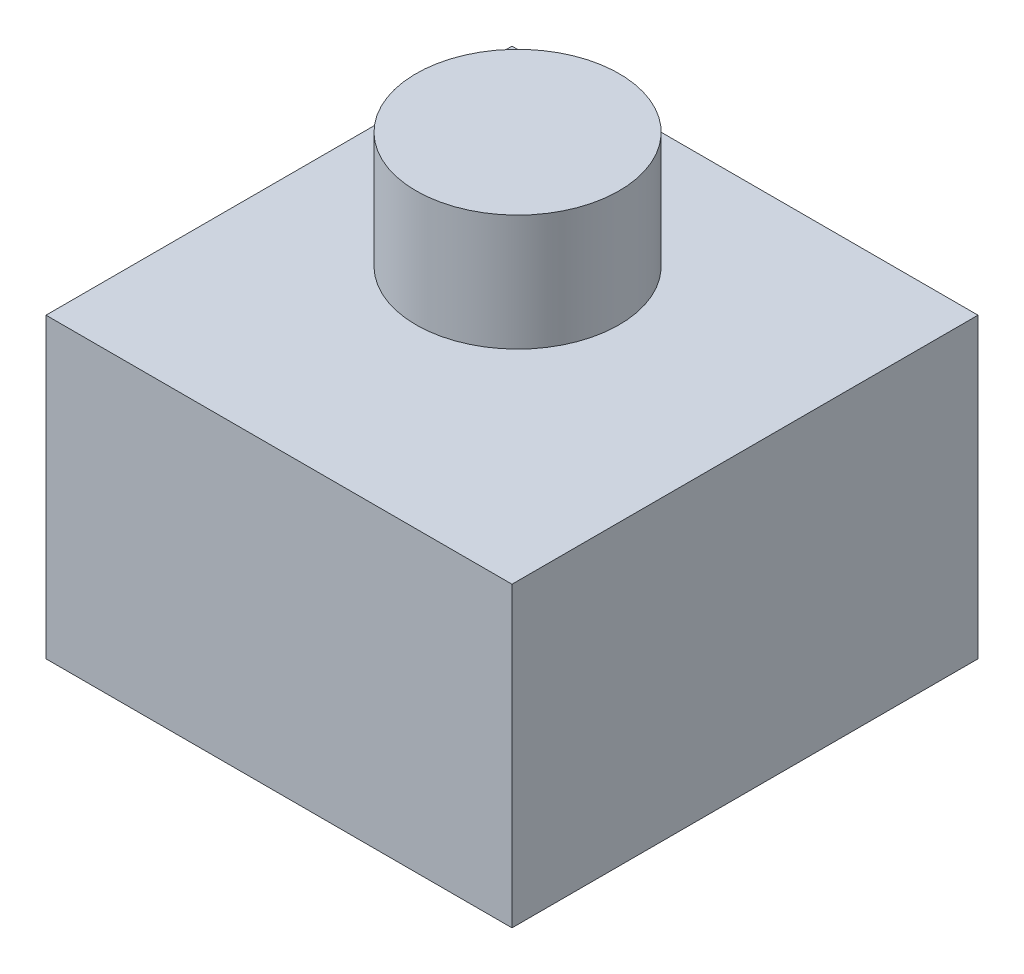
ISO-10303-21;
HEADER;
FILE_DESCRIPTION(('STEP AP214'),'2;1');
FILE_NAME('part.step','',(''),(''),'','','');
FILE_SCHEMA(('AUTOMOTIVE_DESIGN { 1 0 10303 214 1 1 1 1 }'));
ENDSEC;
DATA;
#1=APPLICATION_CONTEXT('core data for automotive mechanical design processes');
#2=APPLICATION_PROTOCOL_DEFINITION('international standard','automotive_design',2000,#1);
#3=PRODUCT_CONTEXT('',#1,'mechanical');
#4=PRODUCT('Part','Part','',(#3));
#5=PRODUCT_RELATED_PRODUCT_CATEGORY('part','',(#4));
#6=PRODUCT_DEFINITION_FORMATION('','',#4);
#7=PRODUCT_DEFINITION_CONTEXT('part definition',#1,'design');
#8=PRODUCT_DEFINITION('design','',#6,#7);
#9=PRODUCT_DEFINITION_SHAPE('','',#8);
#10=(LENGTH_UNIT() NAMED_UNIT(*) SI_UNIT(.MILLI.,.METRE.));
#11=(NAMED_UNIT(*) PLANE_ANGLE_UNIT() SI_UNIT($,.RADIAN.));
#12=(NAMED_UNIT(*) SI_UNIT($,.STERADIAN.) SOLID_ANGLE_UNIT());
#13=UNCERTAINTY_MEASURE_WITH_UNIT(LENGTH_MEASURE(1.E-05),#10,'distance_accuracy_value','');
#14=(GEOMETRIC_REPRESENTATION_CONTEXT(3) GLOBAL_UNCERTAINTY_ASSIGNED_CONTEXT((#13)) GLOBAL_UNIT_ASSIGNED_CONTEXT((#10,
#11,#12)) REPRESENTATION_CONTEXT('',''));
#15=CARTESIAN_POINT('',(0.,0.,0.));
#16=DIRECTION('',(0.,0.,1.));
#17=DIRECTION('',(1.,0.,0.));
#18=AXIS2_PLACEMENT_3D('',#15,#16,#17);
#19=CARTESIAN_POINT('',(-48.7636206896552,62.2905206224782,48.7636206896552));
#20=DIRECTION('',(0.,1.,0.));
#21=DIRECTION('',(0.,0.,1.));
#22=AXIS2_PLACEMENT_3D('',#19,#20,#21);
#23=PLANE('',#22);
#24=DIRECTION('',(0.,0.,1.));
#25=VECTOR('',#24,1.);
#26=CARTESIAN_POINT('',(-48.7636206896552,62.2905206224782,-48.7636206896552));
#27=LINE('',#26,#25);
#28=CARTESIAN_POINT('',(-48.7636206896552,62.2905206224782,-48.7636206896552));
#29=VERTEX_POINT('',#28);
#30=CARTESIAN_POINT('',(-48.7636206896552,62.2905206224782,48.7636206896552));
#31=VERTEX_POINT('',#30);
#32=EDGE_CURVE('E94',#29,#31,#27,.T.);
#33=ORIENTED_EDGE('',*,*,#32,.T.);
#34=DIRECTION('',(1.,0.,0.));
#35=VECTOR('',#34,1.);
#36=CARTESIAN_POINT('',(-48.7636206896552,62.2905206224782,48.7636206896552));
#37=LINE('',#36,#35);
#38=CARTESIAN_POINT('',(48.7636206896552,62.2905206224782,48.7636206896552));
#39=VERTEX_POINT('',#38);
#40=EDGE_CURVE('E79',#31,#39,#37,.T.);
#41=ORIENTED_EDGE('',*,*,#40,.T.);
#42=DIRECTION('',(0.,0.,-1.));
#43=VECTOR('',#42,1.);
#44=CARTESIAN_POINT('',(48.7636206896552,62.2905206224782,-48.7636206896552));
#45=LINE('',#44,#43);
#46=CARTESIAN_POINT('',(48.7636206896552,62.2905206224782,-48.7636206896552));
#47=VERTEX_POINT('',#46);
#48=EDGE_CURVE('E46',#39,#47,#45,.T.);
#49=ORIENTED_EDGE('',*,*,#48,.T.);
#50=DIRECTION('',(-1.,0.,0.));
#51=VECTOR('',#50,1.);
#52=CARTESIAN_POINT('',(-48.7636206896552,62.2905206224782,-48.7636206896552));
#53=LINE('',#52,#51);
#54=EDGE_CURVE('E41',#47,#29,#53,.T.);
#55=ORIENTED_EDGE('',*,*,#54,.T.);
#56=EDGE_LOOP('',(#33,#41,#49,#55));
#57=FACE_BOUND('',#56,.T.);
#58=CARTESIAN_POINT('',(-8.2832576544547,62.2905206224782,-9.45298710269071));
#59=DIRECTION('',(0.,1.,0.));
#60=DIRECTION('',(0.,0.,1.));
#61=AXIS2_PLACEMENT_3D('',#58,#59,#60);
#62=CIRCLE('',#61,21.2535914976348);
#63=CARTESIAN_POINT('',(-8.2832576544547,62.2905206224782,11.8006043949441));
#64=VERTEX_POINT('',#63);
#65=EDGE_CURVE('E87',#64,#64,#62,.T.);
#66=ORIENTED_EDGE('',*,*,#65,.F.);
#67=EDGE_LOOP('',(#66));
#68=FACE_BOUND('',#67,.T.);
#69=ADVANCED_FACE('F26',(#57,#68),#23,.T.);
#70=CARTESIAN_POINT('',(-48.7636206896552,62.2905206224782,-48.7636206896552));
#71=DIRECTION('',(1.,0.,0.));
#72=DIRECTION('',(0.,0.,-1.));
#73=AXIS2_PLACEMENT_3D('',#70,#71,#72);
#74=PLANE('',#73);
#75=DIRECTION('',(0.,0.,1.));
#76=VECTOR('',#75,1.);
#77=CARTESIAN_POINT('',(-48.7636206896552,0.,-48.7636206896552));
#78=LINE('',#77,#76);
#79=CARTESIAN_POINT('',(-48.7636206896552,0.,-48.7636206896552));
#80=VERTEX_POINT('',#79);
#81=CARTESIAN_POINT('',(-48.7636206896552,0.,48.7636206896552));
#82=VERTEX_POINT('',#81);
#83=EDGE_CURVE('E71',#80,#82,#78,.T.);
#84=ORIENTED_EDGE('',*,*,#83,.T.);
#85=DIRECTION('',(0.,-1.,0.));
#86=VECTOR('',#85,1.);
#87=CARTESIAN_POINT('',(-48.7636206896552,62.2905206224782,48.7636206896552));
#88=LINE('',#87,#86);
#89=EDGE_CURVE('E11',#31,#82,#88,.T.);
#90=ORIENTED_EDGE('',*,*,#89,.F.);
#91=ORIENTED_EDGE('',*,*,#32,.F.);
#92=DIRECTION('',(0.,-1.,0.));
#93=VECTOR('',#92,1.);
#94=CARTESIAN_POINT('',(-48.7636206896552,62.2905206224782,-48.7636206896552));
#95=LINE('',#94,#93);
#96=EDGE_CURVE('E83',#29,#80,#95,.T.);
#97=ORIENTED_EDGE('',*,*,#96,.T.);
#98=EDGE_LOOP('',(#84,#90,#91,#97));
#99=FACE_BOUND('',#98,.T.);
#100=ADVANCED_FACE('F28',(#99),#74,.F.);
#101=CARTESIAN_POINT('',(-48.7636206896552,62.2905206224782,48.7636206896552));
#102=DIRECTION('',(0.,0.,-1.));
#103=DIRECTION('',(-1.,0.,0.));
#104=AXIS2_PLACEMENT_3D('',#101,#102,#103);
#105=PLANE('',#104);
#106=DIRECTION('',(1.,0.,0.));
#107=VECTOR('',#106,1.);
#108=CARTESIAN_POINT('',(-48.7636206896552,0.,48.7636206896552));
#109=LINE('',#108,#107);
#110=CARTESIAN_POINT('',(48.7636206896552,0.,48.7636206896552));
#111=VERTEX_POINT('',#110);
#112=EDGE_CURVE('E67',#82,#111,#109,.T.);
#113=ORIENTED_EDGE('',*,*,#112,.T.);
#114=DIRECTION('',(0.,-1.,0.));
#115=VECTOR('',#114,1.);
#116=CARTESIAN_POINT('',(48.7636206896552,62.2905206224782,48.7636206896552));
#117=LINE('',#116,#115);
#118=EDGE_CURVE('E34',#39,#111,#117,.T.);
#119=ORIENTED_EDGE('',*,*,#118,.F.);
#120=ORIENTED_EDGE('',*,*,#40,.F.);
#121=ORIENTED_EDGE('',*,*,#89,.T.);
#122=EDGE_LOOP('',(#113,#119,#120,#121));
#123=FACE_BOUND('',#122,.T.);
#124=ADVANCED_FACE('F78',(#123),#105,.F.);
#125=CARTESIAN_POINT('',(48.7636206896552,62.2905206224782,-48.7636206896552));
#126=DIRECTION('',(-1.,0.,0.));
#127=DIRECTION('',(0.,0.,1.));
#128=AXIS2_PLACEMENT_3D('',#125,#126,#127);
#129=PLANE('',#128);
#130=DIRECTION('',(0.,0.,-1.));
#131=VECTOR('',#130,1.);
#132=CARTESIAN_POINT('',(48.7636206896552,0.,-48.7636206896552));
#133=LINE('',#132,#131);
#134=CARTESIAN_POINT('',(48.7636206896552,0.,-48.7636206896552));
#135=VERTEX_POINT('',#134);
#136=EDGE_CURVE('E72',#111,#135,#133,.T.);
#137=ORIENTED_EDGE('',*,*,#136,.T.);
#138=DIRECTION('',(0.,-1.,0.));
#139=VECTOR('',#138,1.);
#140=CARTESIAN_POINT('',(48.7636206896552,62.2905206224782,-48.7636206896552));
#141=LINE('',#140,#139);
#142=EDGE_CURVE('E100',#47,#135,#141,.T.);
#143=ORIENTED_EDGE('',*,*,#142,.F.);
#144=ORIENTED_EDGE('',*,*,#48,.F.);
#145=ORIENTED_EDGE('',*,*,#118,.T.);
#146=EDGE_LOOP('',(#137,#143,#144,#145));
#147=FACE_BOUND('',#146,.T.);
#148=ADVANCED_FACE('F103',(#147),#129,.F.);
#149=CARTESIAN_POINT('',(-48.7636206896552,62.2905206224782,-48.7636206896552));
#150=DIRECTION('',(0.,0.,1.));
#151=DIRECTION('',(1.,0.,0.));
#152=AXIS2_PLACEMENT_3D('',#149,#150,#151);
#153=PLANE('',#152);
#154=DIRECTION('',(-1.,0.,0.));
#155=VECTOR('',#154,1.);
#156=CARTESIAN_POINT('',(-48.7636206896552,0.,-48.7636206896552));
#157=LINE('',#156,#155);
#158=EDGE_CURVE('E92',#135,#80,#157,.T.);
#159=ORIENTED_EDGE('',*,*,#158,.T.);
#160=ORIENTED_EDGE('',*,*,#96,.F.);
#161=ORIENTED_EDGE('',*,*,#54,.F.);
#162=ORIENTED_EDGE('',*,*,#142,.T.);
#163=EDGE_LOOP('',(#159,#160,#161,#162));
#164=FACE_BOUND('',#163,.T.);
#165=ADVANCED_FACE('F105',(#164),#153,.F.);
#166=CARTESIAN_POINT('',(-48.7636206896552,0.,48.7636206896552));
#167=DIRECTION('',(0.,1.,0.));
#168=DIRECTION('',(0.,0.,1.));
#169=AXIS2_PLACEMENT_3D('',#166,#167,#168);
#170=PLANE('',#169);
#171=ORIENTED_EDGE('',*,*,#83,.F.);
#172=ORIENTED_EDGE('',*,*,#158,.F.);
#173=ORIENTED_EDGE('',*,*,#136,.F.);
#174=ORIENTED_EDGE('',*,*,#112,.F.);
#175=EDGE_LOOP('',(#171,#172,#173,#174));
#176=FACE_BOUND('',#175,.T.);
#177=ADVANCED_FACE('F68',(#176),#170,.F.);
#178=CARTESIAN_POINT('',(-8.2832576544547,86.5810412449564,-9.45298710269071));
#179=DIRECTION('',(0.,-1.,0.));
#180=DIRECTION('',(0.,0.,-1.));
#181=AXIS2_PLACEMENT_3D('',#178,#179,#180);
#182=CYLINDRICAL_SURFACE('',#181,21.2535914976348);
#183=CARTESIAN_POINT('',(-8.2832576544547,86.5810412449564,-9.45298710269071));
#184=DIRECTION('',(0.,1.,0.));
#185=DIRECTION('',(0.,0.,1.));
#186=AXIS2_PLACEMENT_3D('',#183,#184,#185);
#187=CIRCLE('',#186,21.2535914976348);
#188=CARTESIAN_POINT('',(-8.2832576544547,86.5810412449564,11.8006043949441));
#189=VERTEX_POINT('',#188);
#190=EDGE_CURVE('E84',#189,#189,#187,.T.);
#191=ORIENTED_EDGE('',*,*,#190,.F.);
#192=EDGE_LOOP('',(#191));
#193=FACE_BOUND('',#192,.T.);
#194=ORIENTED_EDGE('',*,*,#65,.T.);
#195=EDGE_LOOP('',(#194));
#196=FACE_BOUND('',#195,.T.);
#197=ADVANCED_FACE('F112',(#193,#196),#182,.T.);
#198=CARTESIAN_POINT('',(-8.2832576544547,86.5810412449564,-9.45298710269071));
#199=DIRECTION('',(0.,1.,0.));
#200=DIRECTION('',(0.,0.,1.));
#201=AXIS2_PLACEMENT_3D('',#198,#199,#200);
#202=PLANE('',#201);
#203=ORIENTED_EDGE('',*,*,#190,.T.);
#204=EDGE_LOOP('',(#203));
#205=FACE_BOUND('',#204,.T.);
#206=ADVANCED_FACE('F114',(#205),#202,.T.);
#207=CLOSED_SHELL('',(#69,#100,#124,#148,#165,#177,#197,#206));
#208=MANIFOLD_SOLID_BREP('B2',#207);
#209=ADVANCED_BREP_SHAPE_REPRESENTATION('',(#18,#208),#14);
#210=SHAPE_DEFINITION_REPRESENTATION(#9,#209);
ENDSEC;
END-ISO-10303-21;
